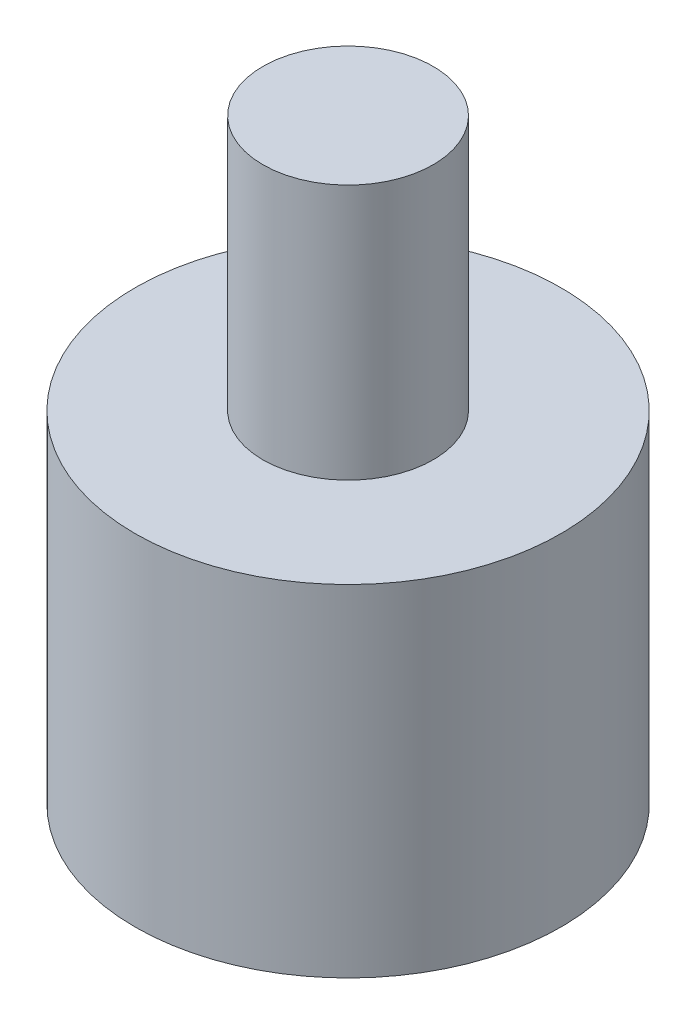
from build123d import *

# Parameters (mm, degrees)
SKETCH1_R           = 5
BOSS_EXTRUDE1_DEPTH = 8
SKETCH2_R           = 2
BOSS_EXTRUDE2_DEPTH = 6


with BuildPart() as part:
    # Sketch1 → Boss-Extrude1 (new body)
    with BuildSketch(Plane(origin=(0, 0, 0), x_dir=(1, 0, 0), z_dir=(0, 1, 0))):
        with Locations(Location((0, 0, 0), (0, 0, 270))):
            Circle(SKETCH1_R)
    extrude(amount=BOSS_EXTRUDE1_DEPTH)

    # Sketch2 → Boss-Extrude2 (add)
    with BuildSketch(Plane(origin=(0, 8, 0), x_dir=(1, 0, 0), z_dir=(0, 1, 0))):
        with Locations(Location((0, 0, 0), (0, 0, 270))):
            Circle(SKETCH2_R)
    extrude(amount=BOSS_EXTRUDE2_DEPTH)


solid = part.part
